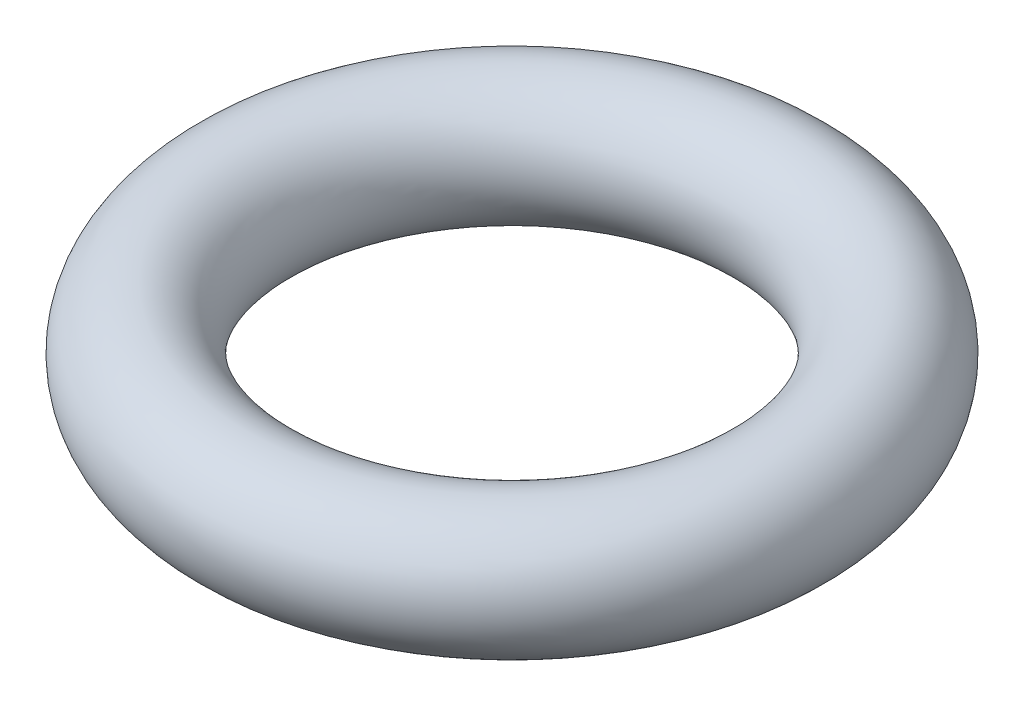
from build123d import *

# Parameters (mm, degrees)
SKETCH1_R = 0.8


with BuildPart() as part:
    # Sketch1 → Revolve1 (revolve)
    with BuildSketch(Plane.XY, mode=Mode.PRIVATE) as revolve1_sk:
        with Locations((3.35, 0)):
            Circle(SKETCH1_R)
    revolve(revolve1_sk.sketch.rotate(Axis((0, -979.826032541, 0), (0, 1, 0)), 90), axis=Axis((0, -979.826032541, 0), (0, 1, 0)))


solid = part.part
